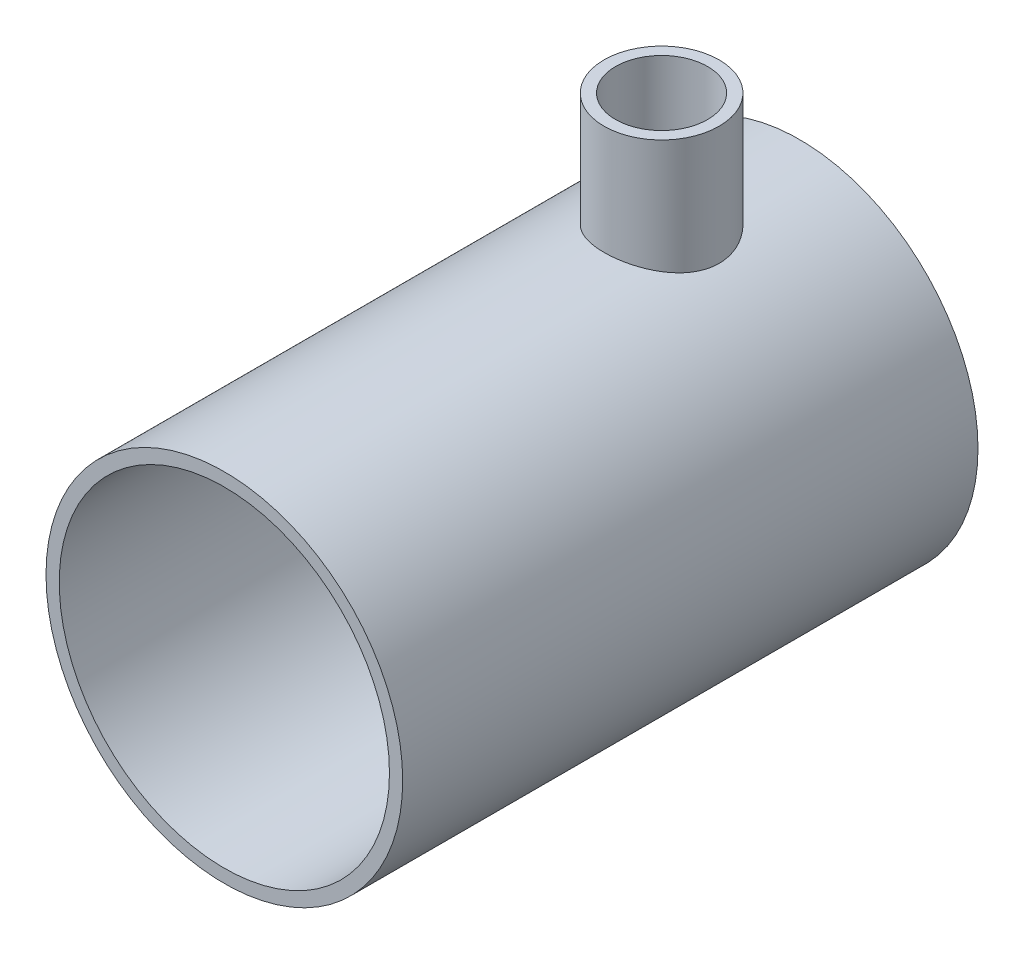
from build123d import *

# Parameters (mm, degrees)
CROQUIS1_R                 = 15.5
CROQUIS1_R_2               = 14.35
SALIENTE_EXTRUIR1_DEPTH    = 50
CROQUIS2_R                 = 5
SALIENTE_EXTRUIR2_DEPTH    = 25
CORTAR_EXTRUIR1_REACH      = 60.011
CROQUIS3_R                 = 14.35
CORTAR_EXTRUIR2_REACH      = 68.185
CORTAR_EXTRUIR2_END_RADIUS = 14.35
CROQUIS4_R                 = 4


with BuildPart() as part:
    # Croquis1 → Saliente-Extruir1 (new body)
    with BuildSketch(Plane.XY):
        Circle(CROQUIS1_R)
        Circle(CROQUIS1_R_2, mode=Mode.SUBTRACT)
    extrude(amount=SALIENTE_EXTRUIR1_DEPTH)

    # Croquis2 → Saliente-Extruir2 (add)
    with BuildSketch(Plane(origin=(0, 0, 0), x_dir=(1, 0, 0), z_dir=(0, 1, 0))):
        with Locations(Location((0, -12, 0), (0, 0, 90))):
            Circle(CROQUIS2_R)
    extrude(amount=SALIENTE_EXTRUIR2_DEPTH)

    # Croquis3 → Cortar-Extruir1 (cut, up to next)
    with BuildSketch(Plane.XY.offset(50), mode=Mode.PRIVATE) as cortar_extruir1_sk1:
        Circle(CROQUIS3_R)
    cortar_extruir1_tool1 = extrude(cortar_extruir1_sk1.sketch, amount=-CORTAR_EXTRUIR1_REACH, mode=Mode.PRIVATE) & part.part
    add(cortar_extruir1_tool1.solids().sort_by_distance((0, 0, 50))[0], mode=Mode.SUBTRACT)

    # Cortar-Extruir2: up to this cylinder (the profile starts outside it)
    cortar_extruir2_end = Plane(origin=(0, 0, 12), z_dir=(0, 0, -1)) * Cylinder(CORTAR_EXTRUIR2_END_RADIUS, 166.07, mode=Mode.PRIVATE)
    # Croquis4 → Cortar-Extruir2 (cut, up to the surface)
    with BuildSketch(Plane(origin=(0, 25, 0), x_dir=(1, 0, 0), z_dir=(0, 1, 0)), mode=Mode.PRIVATE) as cortar_extruir2_sk1:
        with Locations(Location((0, -12, 0), (0, 0, 270))):
            Circle(CROQUIS4_R)
    cortar_extruir2_tool1 = extrude(cortar_extruir2_sk1.sketch, amount=-CORTAR_EXTRUIR2_REACH, mode=Mode.PRIVATE) - cortar_extruir2_end
    add(cortar_extruir2_tool1.solids().sort_by_distance((0, 25, 12))[0], mode=Mode.SUBTRACT)


solid = part.part
